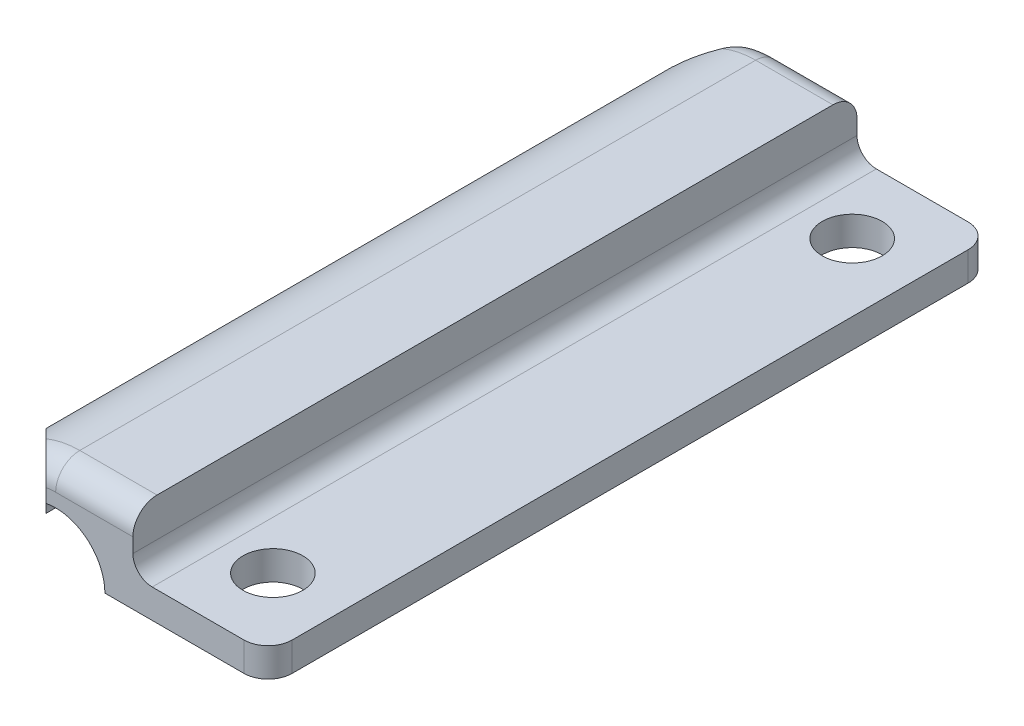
ISO-10303-21;
HEADER;
FILE_DESCRIPTION(('STEP AP214'),'2;1');
FILE_NAME('part.step','',(''),(''),'','','');
FILE_SCHEMA(('AUTOMOTIVE_DESIGN { 1 0 10303 214 1 1 1 1 }'));
ENDSEC;
DATA;
#1=APPLICATION_CONTEXT('core data for automotive mechanical design processes');
#2=APPLICATION_PROTOCOL_DEFINITION('international standard','automotive_design',2000,#1);
#3=PRODUCT_CONTEXT('',#1,'mechanical');
#4=PRODUCT('Part','Part','',(#3));
#5=PRODUCT_RELATED_PRODUCT_CATEGORY('part','',(#4));
#6=PRODUCT_DEFINITION_FORMATION('','',#4);
#7=PRODUCT_DEFINITION_CONTEXT('part definition',#1,'design');
#8=PRODUCT_DEFINITION('design','',#6,#7);
#9=PRODUCT_DEFINITION_SHAPE('','',#8);
#10=(LENGTH_UNIT() NAMED_UNIT(*) SI_UNIT(.MILLI.,.METRE.));
#11=(NAMED_UNIT(*) PLANE_ANGLE_UNIT() SI_UNIT($,.RADIAN.));
#12=(NAMED_UNIT(*) SI_UNIT($,.STERADIAN.) SOLID_ANGLE_UNIT());
#13=UNCERTAINTY_MEASURE_WITH_UNIT(LENGTH_MEASURE(1.E-05),#10,'distance_accuracy_value','');
#14=(GEOMETRIC_REPRESENTATION_CONTEXT(3) GLOBAL_UNCERTAINTY_ASSIGNED_CONTEXT((#13)) GLOBAL_UNIT_ASSIGNED_CONTEXT((#10,
#11,#12)) REPRESENTATION_CONTEXT('',''));
#15=CARTESIAN_POINT('',(0.,0.,0.));
#16=DIRECTION('',(0.,0.,1.));
#17=DIRECTION('',(1.,0.,0.));
#18=AXIS2_PLACEMENT_3D('',#15,#16,#17);
#19=CARTESIAN_POINT('',(24.,-3.4,15.));
#20=DIRECTION('',(0.,-1.,0.));
#21=DIRECTION('',(0.,0.,-1.));
#22=AXIS2_PLACEMENT_3D('',#19,#20,#21);
#23=PLANE('',#22);
#24=CARTESIAN_POINT('',(24.,-3.4,15.));
#25=DIRECTION('',(0.,1.,0.));
#26=DIRECTION('',(0.,0.,1.));
#27=AXIS2_PLACEMENT_3D('',#24,#25,#26);
#28=CIRCLE('',#27,3.);
#29=CARTESIAN_POINT('',(24.,-3.4,18.));
#30=VERTEX_POINT('',#29);
#31=EDGE_CURVE('E20',#30,#30,#28,.T.);
#32=ORIENTED_EDGE('',*,*,#31,.F.);
#33=EDGE_LOOP('',(#32));
#34=FACE_BOUND('',#33,.T.);
#35=ADVANCED_FACE('F17',(#34),#23,.T.);
#36=CARTESIAN_POINT('',(24.,-3.4,-15.));
#37=DIRECTION('',(0.,-1.,0.));
#38=DIRECTION('',(0.,0.,-1.));
#39=AXIS2_PLACEMENT_3D('',#36,#37,#38);
#40=PLANE('',#39);
#41=CARTESIAN_POINT('',(24.,-3.4,-15.));
#42=DIRECTION('',(0.,1.,0.));
#43=DIRECTION('',(0.,0.,1.));
#44=AXIS2_PLACEMENT_3D('',#41,#42,#43);
#45=CIRCLE('',#44,3.);
#46=CARTESIAN_POINT('',(24.,-3.4,-12.));
#47=VERTEX_POINT('',#46);
#48=EDGE_CURVE('E377',#47,#47,#45,.T.);
#49=ORIENTED_EDGE('',*,*,#48,.F.);
#50=EDGE_LOOP('',(#49));
#51=FACE_BOUND('',#50,.T.);
#52=ADVANCED_FACE('F387',(#51),#40,.T.);
#53=CARTESIAN_POINT('',(0.,9.,37.5));
#54=DIRECTION('',(0.,-1.,0.));
#55=DIRECTION('',(0.,0.,-1.));
#56=AXIS2_PLACEMENT_3D('',#53,#54,#55);
#57=PLANE('',#56);
#58=DIRECTION('',(0.,0.,-1.));
#59=VECTOR('',#58,1.);
#60=CARTESIAN_POINT('',(9.,9.,37.5));
#61=LINE('',#60,#59);
#62=CARTESIAN_POINT('',(9.,9.00000000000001,35.));
#63=VERTEX_POINT('',#62);
#64=CARTESIAN_POINT('',(9.,9.,-35.));
#65=VERTEX_POINT('',#64);
#66=EDGE_CURVE('E138',#63,#65,#61,.T.);
#67=ORIENTED_EDGE('',*,*,#66,.F.);
#68=DIRECTION('',(-1.,0.,0.));
#69=VECTOR('',#68,1.);
#70=CARTESIAN_POINT('',(0.,9.00000000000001,35.));
#71=LINE('',#70,#69);
#72=CARTESIAN_POINT('',(17.,9.00000000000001,35.));
#73=VERTEX_POINT('',#72);
#74=EDGE_CURVE('E141',#73,#63,#71,.T.);
#75=ORIENTED_EDGE('',*,*,#74,.F.);
#76=DIRECTION('',(0.,0.,1.));
#77=VECTOR('',#76,1.);
#78=CARTESIAN_POINT('',(17.,9.,37.5));
#79=LINE('',#78,#77);
#80=CARTESIAN_POINT('',(17.,9.00000000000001,-35.));
#81=VERTEX_POINT('',#80);
#82=EDGE_CURVE('E277',#73,#81,#79,.F.);
#83=ORIENTED_EDGE('',*,*,#82,.T.);
#84=DIRECTION('',(1.,0.,0.));
#85=VECTOR('',#84,1.);
#86=CARTESIAN_POINT('',(0.,9.00000000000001,-35.));
#87=LINE('',#86,#85);
#88=EDGE_CURVE('E115',#65,#81,#87,.T.);
#89=ORIENTED_EDGE('',*,*,#88,.F.);
#90=EDGE_LOOP('',(#67,#75,#83,#89));
#91=FACE_BOUND('',#90,.T.);
#92=ADVANCED_FACE('F140',(#91),#57,.F.);
#93=CARTESIAN_POINT('',(17.,3.,37.5));
#94=DIRECTION('',(-1.,0.,0.));
#95=DIRECTION('',(0.,0.,1.));
#96=AXIS2_PLACEMENT_3D('',#93,#94,#95);
#97=PLANE('',#96);
#98=CARTESIAN_POINT('',(17.,6.5,-35.));
#99=DIRECTION('',(1.,0.,0.));
#100=DIRECTION('',(0.,0.,-1.));
#101=AXIS2_PLACEMENT_3D('',#98,#99,#100);
#102=CIRCLE('',#101,2.5);
#103=CARTESIAN_POINT('',(17.,6.5,-37.5));
#104=VERTEX_POINT('',#103);
#105=EDGE_CURVE('E270',#81,#104,#102,.F.);
#106=ORIENTED_EDGE('',*,*,#105,.F.);
#107=ORIENTED_EDGE('',*,*,#82,.F.);
#108=CARTESIAN_POINT('',(17.,6.5,35.));
#109=DIRECTION('',(-1.,0.,0.));
#110=DIRECTION('',(0.,0.,1.));
#111=AXIS2_PLACEMENT_3D('',#108,#109,#110);
#112=CIRCLE('',#111,2.5);
#113=CARTESIAN_POINT('',(17.,6.5,37.5));
#114=VERTEX_POINT('',#113);
#115=EDGE_CURVE('E155',#114,#73,#112,.T.);
#116=ORIENTED_EDGE('',*,*,#115,.F.);
#117=DIRECTION('',(0.,1.,0.));
#118=VECTOR('',#117,1.);
#119=CARTESIAN_POINT('',(17.,3.,37.5));
#120=LINE('',#119,#118);
#121=CARTESIAN_POINT('',(17.,5.,37.5));
#122=VERTEX_POINT('',#121);
#123=EDGE_CURVE('E279',#122,#114,#120,.T.);
#124=ORIENTED_EDGE('',*,*,#123,.F.);
#125=DIRECTION('',(0.,0.,1.));
#126=VECTOR('',#125,1.);
#127=CARTESIAN_POINT('',(17.,5.,37.5));
#128=LINE('',#127,#126);
#129=CARTESIAN_POINT('',(17.,5.,-37.5));
#130=VERTEX_POINT('',#129);
#131=EDGE_CURVE('E168',#122,#130,#128,.F.);
#132=ORIENTED_EDGE('',*,*,#131,.T.);
#133=DIRECTION('',(0.,1.,0.));
#134=VECTOR('',#133,1.);
#135=CARTESIAN_POINT('',(17.,3.,-37.5));
#136=LINE('',#135,#134);
#137=EDGE_CURVE('E275',#104,#130,#136,.F.);
#138=ORIENTED_EDGE('',*,*,#137,.F.);
#139=EDGE_LOOP('',(#106,#107,#116,#124,#132,#138));
#140=FACE_BOUND('',#139,.T.);
#141=ADVANCED_FACE('F293',(#140),#97,.F.);
#142=CARTESIAN_POINT('',(24.,-3.4,15.));
#143=DIRECTION('',(0.,1.,0.));
#144=DIRECTION('',(0.,0.,1.));
#145=AXIS2_PLACEMENT_3D('',#142,#143,#144);
#146=CYLINDRICAL_SURFACE('',#145,3.);
#147=CARTESIAN_POINT('',(24.,0.,15.));
#148=DIRECTION('',(0.,1.,0.));
#149=DIRECTION('',(0.,0.,1.));
#150=AXIS2_PLACEMENT_3D('',#147,#148,#149);
#151=CIRCLE('',#150,3.);
#152=CARTESIAN_POINT('',(24.,0.,18.));
#153=VERTEX_POINT('',#152);
#154=EDGE_CURVE('E369',#153,#153,#151,.F.);
#155=ORIENTED_EDGE('',*,*,#154,.T.);
#156=EDGE_LOOP('',(#155));
#157=FACE_BOUND('',#156,.T.);
#158=ORIENTED_EDGE('',*,*,#31,.T.);
#159=EDGE_LOOP('',(#158));
#160=FACE_BOUND('',#159,.T.);
#161=ADVANCED_FACE('F384',(#157,#160),#146,.T.);
#162=CARTESIAN_POINT('',(24.,-3.4,-15.));
#163=DIRECTION('',(0.,1.,0.));
#164=DIRECTION('',(0.,0.,1.));
#165=AXIS2_PLACEMENT_3D('',#162,#163,#164);
#166=CYLINDRICAL_SURFACE('',#165,3.);
#167=ORIENTED_EDGE('',*,*,#48,.T.);
#168=EDGE_LOOP('',(#167));
#169=FACE_BOUND('',#168,.T.);
#170=CARTESIAN_POINT('',(24.,0.,-15.));
#171=DIRECTION('',(0.,1.,0.));
#172=DIRECTION('',(0.,0.,1.));
#173=AXIS2_PLACEMENT_3D('',#170,#171,#172);
#174=CIRCLE('',#173,3.);
#175=CARTESIAN_POINT('',(24.,0.,-12.));
#176=VERTEX_POINT('',#175);
#177=EDGE_CURVE('E366',#176,#176,#174,.F.);
#178=ORIENTED_EDGE('',*,*,#177,.T.);
#179=EDGE_LOOP('',(#178));
#180=FACE_BOUND('',#179,.T.);
#181=ADVANCED_FACE('F465',(#169,#180),#166,.T.);
#182=CARTESIAN_POINT('',(24.,0.,-30.));
#183=DIRECTION('',(0.,1.,0.));
#184=DIRECTION('',(0.,0.,1.));
#185=AXIS2_PLACEMENT_3D('',#182,#183,#184);
#186=CYLINDRICAL_SURFACE('',#185,3.1);
#187=CARTESIAN_POINT('',(24.,0.,-30.));
#188=DIRECTION('',(0.,1.,0.));
#189=DIRECTION('',(0.,0.,1.));
#190=AXIS2_PLACEMENT_3D('',#187,#188,#189);
#191=CIRCLE('',#190,3.1);
#192=CARTESIAN_POINT('',(24.,0.,-26.9));
#193=VERTEX_POINT('',#192);
#194=EDGE_CURVE('E363',#193,#193,#191,.F.);
#195=ORIENTED_EDGE('',*,*,#194,.T.);
#196=EDGE_LOOP('',(#195));
#197=FACE_BOUND('',#196,.T.);
#198=CARTESIAN_POINT('',(24.,3.,-30.));
#199=DIRECTION('',(0.,1.,0.));
#200=DIRECTION('',(0.,0.,1.));
#201=AXIS2_PLACEMENT_3D('',#198,#199,#200);
#202=CIRCLE('',#201,3.1);
#203=CARTESIAN_POINT('',(24.,3.,-26.9));
#204=VERTEX_POINT('',#203);
#205=EDGE_CURVE('E344',#204,#204,#202,.T.);
#206=ORIENTED_EDGE('',*,*,#205,.T.);
#207=EDGE_LOOP('',(#206));
#208=FACE_BOUND('',#207,.T.);
#209=ADVANCED_FACE('F461',(#197,#208),#186,.F.);
#210=CARTESIAN_POINT('',(31.,0.,37.5));
#211=DIRECTION('',(-1.,0.,0.));
#212=DIRECTION('',(0.,0.,1.));
#213=AXIS2_PLACEMENT_3D('',#210,#211,#212);
#214=PLANE('',#213);
#215=DIRECTION('',(0.,-1.,0.));
#216=VECTOR('',#215,1.);
#217=CARTESIAN_POINT('',(31.,0.,-35.));
#218=LINE('',#217,#216);
#219=CARTESIAN_POINT('',(31.,3.,-35.));
#220=VERTEX_POINT('',#219);
#221=CARTESIAN_POINT('',(31.,0.,-35.));
#222=VERTEX_POINT('',#221);
#223=EDGE_CURVE('E266',#220,#222,#218,.T.);
#224=ORIENTED_EDGE('',*,*,#223,.F.);
#225=DIRECTION('',(0.,0.,-1.));
#226=VECTOR('',#225,1.);
#227=CARTESIAN_POINT('',(31.,3.,37.5));
#228=LINE('',#227,#226);
#229=CARTESIAN_POINT('',(31.,3.,35.));
#230=VERTEX_POINT('',#229);
#231=EDGE_CURVE('E342',#220,#230,#228,.F.);
#232=ORIENTED_EDGE('',*,*,#231,.T.);
#233=DIRECTION('',(0.,1.,0.));
#234=VECTOR('',#233,1.);
#235=CARTESIAN_POINT('',(31.,9.,35.));
#236=LINE('',#235,#234);
#237=CARTESIAN_POINT('',(31.,0.,35.));
#238=VERTEX_POINT('',#237);
#239=EDGE_CURVE('E271',#238,#230,#236,.T.);
#240=ORIENTED_EDGE('',*,*,#239,.F.);
#241=DIRECTION('',(0.,0.,1.));
#242=VECTOR('',#241,1.);
#243=CARTESIAN_POINT('',(31.,0.,37.5));
#244=LINE('',#243,#242);
#245=EDGE_CURVE('E333',#238,#222,#244,.F.);
#246=ORIENTED_EDGE('',*,*,#245,.T.);
#247=EDGE_LOOP('',(#224,#232,#240,#246));
#248=FACE_BOUND('',#247,.T.);
#249=ADVANCED_FACE('F455',(#248),#214,.F.);
#250=CARTESIAN_POINT('',(24.,-3.4,30.));
#251=DIRECTION('',(0.,1.,0.));
#252=DIRECTION('',(0.,0.,1.));
#253=AXIS2_PLACEMENT_3D('',#250,#251,#252);
#254=CYLINDRICAL_SURFACE('',#253,3.1);
#255=CARTESIAN_POINT('',(24.,3.,30.));
#256=DIRECTION('',(0.,1.,0.));
#257=DIRECTION('',(0.,0.,1.));
#258=AXIS2_PLACEMENT_3D('',#255,#256,#257);
#259=CIRCLE('',#258,3.1);
#260=CARTESIAN_POINT('',(24.,3.,33.1));
#261=VERTEX_POINT('',#260);
#262=EDGE_CURVE('E274',#261,#261,#259,.T.);
#263=ORIENTED_EDGE('',*,*,#262,.T.);
#264=EDGE_LOOP('',(#263));
#265=FACE_BOUND('',#264,.T.);
#266=CARTESIAN_POINT('',(24.,0.,30.));
#267=DIRECTION('',(0.,1.,0.));
#268=DIRECTION('',(0.,0.,1.));
#269=AXIS2_PLACEMENT_3D('',#266,#267,#268);
#270=CIRCLE('',#269,3.1);
#271=CARTESIAN_POINT('',(24.,0.,33.1));
#272=VERTEX_POINT('',#271);
#273=EDGE_CURVE('E356',#272,#272,#270,.F.);
#274=ORIENTED_EDGE('',*,*,#273,.T.);
#275=EDGE_LOOP('',(#274));
#276=FACE_BOUND('',#275,.T.);
#277=ADVANCED_FACE('F450',(#265,#276),#254,.F.);
#278=CARTESIAN_POINT('',(0.,6.5,-35.));
#279=DIRECTION('',(1.,0.,0.));
#280=DIRECTION('',(0.,0.,-1.));
#281=AXIS2_PLACEMENT_3D('',#278,#279,#280);
#282=CYLINDRICAL_SURFACE('',#281,2.5);
#283=ORIENTED_EDGE('',*,*,#88,.T.);
#284=ORIENTED_EDGE('',*,*,#105,.T.);
#285=DIRECTION('',(-1.,0.,0.));
#286=VECTOR('',#285,1.);
#287=CARTESIAN_POINT('',(0.,6.5,-37.5));
#288=LINE('',#287,#286);
#289=CARTESIAN_POINT('',(9.,6.5,-37.5));
#290=VERTEX_POINT('',#289);
#291=EDGE_CURVE('E329',#290,#104,#288,.F.);
#292=ORIENTED_EDGE('',*,*,#291,.F.);
#293=CARTESIAN_POINT('',(9.,6.5,-35.));
#294=DIRECTION('',(1.,0.,0.));
#295=DIRECTION('',(0.,1.,0.));
#296=AXIS2_PLACEMENT_3D('',#293,#294,#295);
#297=CIRCLE('',#296,2.5);
#298=EDGE_CURVE('E145',#65,#290,#297,.F.);
#299=ORIENTED_EDGE('',*,*,#298,.F.);
#300=EDGE_LOOP('',(#283,#284,#292,#299));
#301=FACE_BOUND('',#300,.T.);
#302=ADVANCED_FACE('F448',(#301),#282,.T.);
#303=CARTESIAN_POINT('',(28.5,0.,-35.));
#304=DIRECTION('',(0.,-1.,0.));
#305=DIRECTION('',(0.,0.,-1.));
#306=AXIS2_PLACEMENT_3D('',#303,#304,#305);
#307=CYLINDRICAL_SURFACE('',#306,2.5);
#308=CARTESIAN_POINT('',(28.5,3.,-35.));
#309=DIRECTION('',(0.,-1.,0.));
#310=DIRECTION('',(0.,0.,-1.));
#311=AXIS2_PLACEMENT_3D('',#308,#309,#310);
#312=CIRCLE('',#311,2.5);
#313=CARTESIAN_POINT('',(28.5,3.,-37.5));
#314=VERTEX_POINT('',#313);
#315=EDGE_CURVE('E345',#314,#220,#312,.T.);
#316=ORIENTED_EDGE('',*,*,#315,.T.);
#317=ORIENTED_EDGE('',*,*,#223,.T.);
#318=CARTESIAN_POINT('',(28.5,0.,-35.));
#319=DIRECTION('',(0.,-1.,0.));
#320=DIRECTION('',(0.,0.,-1.));
#321=AXIS2_PLACEMENT_3D('',#318,#319,#320);
#322=CIRCLE('',#321,2.5);
#323=CARTESIAN_POINT('',(28.5,0.,-37.5));
#324=VERTEX_POINT('',#323);
#325=EDGE_CURVE('E336',#222,#324,#322,.F.);
#326=ORIENTED_EDGE('',*,*,#325,.T.);
#327=DIRECTION('',(0.,1.,0.));
#328=VECTOR('',#327,1.);
#329=CARTESIAN_POINT('',(28.5,9.,-37.5));
#330=LINE('',#329,#328);
#331=EDGE_CURVE('E247',#314,#324,#330,.F.);
#332=ORIENTED_EDGE('',*,*,#331,.F.);
#333=EDGE_LOOP('',(#316,#317,#326,#332));
#334=FACE_BOUND('',#333,.T.);
#335=ADVANCED_FACE('F237',(#334),#307,.T.);
#336=CARTESIAN_POINT('',(9.,0.,-35.));
#337=DIRECTION('',(0.,0.,-1.));
#338=DIRECTION('',(-1.,0.,0.));
#339=AXIS2_PLACEMENT_3D('',#336,#337,#338);
#340=TOROIDAL_SURFACE('',#339,6.5,2.5);
#341=CARTESIAN_POINT('',(9.,0.,-35.));
#342=DIRECTION('',(0.,0.,-1.));
#343=DIRECTION('',(-1.,0.,0.));
#344=AXIS2_PLACEMENT_3D('',#341,#342,#343);
#345=CIRCLE('',#344,9.);
#346=CARTESIAN_POINT('',(5.50000000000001,8.2915619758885,-35.));
#347=VERTEX_POINT('',#346);
#348=EDGE_CURVE('E144',#65,#347,#345,.F.);
#349=ORIENTED_EDGE('',*,*,#348,.F.);
#350=ORIENTED_EDGE('',*,*,#298,.T.);
#351=CARTESIAN_POINT('',(9.,0.,-37.5));
#352=DIRECTION('',(0.,0.,1.));
#353=DIRECTION('',(0.,1.,0.));
#354=AXIS2_PLACEMENT_3D('',#351,#352,#353);
#355=CIRCLE('',#354,6.5);
#356=CARTESIAN_POINT('',(8.,6.42261628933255,-37.5));
#357=VERTEX_POINT('',#356);
#358=EDGE_CURVE('E255',#357,#290,#355,.F.);
#359=ORIENTED_EDGE('',*,*,#358,.F.);
#360=CARTESIAN_POINT('',(5.5,8.2915619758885,-35.));
#361=CARTESIAN_POINT('',(5.57173141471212,8.32182772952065,-35.0717314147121));
#362=CARTESIAN_POINT('',(5.64428836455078,8.34801576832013,-35.1442883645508));
#363=CARTESIAN_POINT('',(5.79079152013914,8.39174016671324,-35.2907915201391));
#364=CARTESIAN_POINT('',(5.86473945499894,8.40926490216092,-35.3647394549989));
#365=CARTESIAN_POINT('',(6.08874277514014,8.44812316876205,-35.5887427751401));
#366=CARTESIAN_POINT('',(6.2402175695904,8.45542020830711,-35.7402175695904));
#367=CARTESIAN_POINT('',(6.50523072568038,8.4315949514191,-36.0052307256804));
#368=CARTESIAN_POINT('',(6.61919142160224,8.40923002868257,-36.1191914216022));
#369=CARTESIAN_POINT('',(6.84287099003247,8.33867814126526,-36.3428709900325));
#370=CARTESIAN_POINT('',(6.95260134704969,8.29056727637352,-36.4526013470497));
#371=CARTESIAN_POINT('',(7.14509503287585,8.17833129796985,-36.6450950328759));
#372=CARTESIAN_POINT('',(7.22915462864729,8.11865427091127,-36.7291546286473));
#373=CARTESIAN_POINT('',(7.38932492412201,7.98064369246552,-36.889324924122));
#374=CARTESIAN_POINT('',(7.46544010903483,7.90232075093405,-36.9654401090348));
#375=CARTESIAN_POINT('',(7.59488801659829,7.74177865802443,-37.0948880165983));
#376=CARTESIAN_POINT('',(7.64991124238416,7.66228605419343,-37.1499112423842));
#377=CARTESIAN_POINT('',(7.74993312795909,7.4914143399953,-37.2499331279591));
#378=CARTESIAN_POINT('',(7.79493693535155,7.40004137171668,-37.2949369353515));
#379=CARTESIAN_POINT('',(7.85336816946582,7.25533413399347,-37.3533681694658));
#380=CARTESIAN_POINT('',(7.87138375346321,7.20562021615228,-37.3713837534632));
#381=CARTESIAN_POINT('',(7.90407528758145,7.10405180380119,-37.4040752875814));
#382=CARTESIAN_POINT('',(7.91875286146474,7.05219836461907,-37.4187528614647));
#383=CARTESIAN_POINT('',(7.94455694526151,6.94680499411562,-37.4445569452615));
#384=CARTESIAN_POINT('',(7.95568644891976,6.89326652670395,-37.4556864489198));
#385=CARTESIAN_POINT('',(7.97427206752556,6.7849535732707,-37.4742720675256));
#386=CARTESIAN_POINT('',(7.98173015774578,6.73017976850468,-37.4817301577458));
#387=CARTESIAN_POINT('',(7.99157013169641,6.63321080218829,-37.4915701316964));
#388=CARTESIAN_POINT('',(7.99474291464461,6.59117212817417,-37.4947429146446));
#389=CARTESIAN_POINT('',(7.99895806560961,6.50696128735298,-37.4989580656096));
#390=CARTESIAN_POINT('',(8.00000445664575,6.46478952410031,-37.5000044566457));
#391=CARTESIAN_POINT('',(8.,6.42261628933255,-37.5));
#392=B_SPLINE_CURVE_WITH_KNOTS('',3,(#360,#361,#362,#363,#364,#365,#366,#367,#368,#369,#370,
#371,#372,#373,#374,#375,#376,#377,#378,#379,#380,#381,#382,#383,#384,#385,#386,#387,#388,#389,
#390,#391),.UNSPECIFIED.,.F.,.F.,(4,2,2,2,2,2,2,2,2,2,2,2,2,2,2,4),(0.,0.317388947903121,
0.635202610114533,1.27407237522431,1.76039918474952,2.24529638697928,2.64281422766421,
3.04010641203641,3.37249831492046,3.70471905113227,3.87210568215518,4.03941071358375,
4.20657420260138,4.37364765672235,4.50037650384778,4.62686536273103),.UNSPECIFIED.);
#393=EDGE_CURVE('E229',#347,#357,#392,.T.);
#394=ORIENTED_EDGE('',*,*,#393,.F.);
#395=EDGE_LOOP('',(#349,#350,#359,#394));
#396=FACE_BOUND('',#395,.T.);
#397=ADVANCED_FACE('F232',(#396),#340,.T.);
#398=CARTESIAN_POINT('',(9.,0.,37.5));
#399=DIRECTION('',(0.,0.,-1.));
#400=DIRECTION('',(-1.,0.,0.));
#401=AXIS2_PLACEMENT_3D('',#398,#399,#400);
#402=CYLINDRICAL_SURFACE('',#401,9.);
#403=CARTESIAN_POINT('',(9.,0.,-38.5));
#404=DIRECTION('',(-0.707106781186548,0.,-0.707106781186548));
#405=DIRECTION('',(0.707106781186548,0.,-0.707106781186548));
#406=AXIS2_PLACEMENT_3D('',#403,#404,#405);
#407=ELLIPSE('',#406,12.7279220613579,9.);
#408=CARTESIAN_POINT('',(0.,0.,-29.5));
#409=VERTEX_POINT('',#408);
#410=EDGE_CURVE('E230',#409,#347,#407,.T.);
#411=ORIENTED_EDGE('',*,*,#410,.F.);
#412=DIRECTION('',(0.,0.,1.));
#413=VECTOR('',#412,1.);
#414=CARTESIAN_POINT('',(0.,0.,37.5));
#415=LINE('',#414,#413);
#416=CARTESIAN_POINT('',(0.,0.,29.5));
#417=VERTEX_POINT('',#416);
#418=EDGE_CURVE('E245',#409,#417,#415,.T.);
#419=ORIENTED_EDGE('',*,*,#418,.T.);
#420=CARTESIAN_POINT('',(9.,0.,38.5));
#421=DIRECTION('',(0.707106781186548,0.,-0.707106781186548));
#422=DIRECTION('',(-0.707106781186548,0.,-0.707106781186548));
#423=AXIS2_PLACEMENT_3D('',#420,#421,#422);
#424=ELLIPSE('',#423,12.7279220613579,9.);
#425=CARTESIAN_POINT('',(5.5,8.2915619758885,35.));
#426=VERTEX_POINT('',#425);
#427=EDGE_CURVE('E161',#417,#426,#424,.T.);
#428=ORIENTED_EDGE('',*,*,#427,.T.);
#429=CARTESIAN_POINT('',(9.,0.,35.));
#430=DIRECTION('',(0.,0.,-1.));
#431=DIRECTION('',(-1.,0.,0.));
#432=AXIS2_PLACEMENT_3D('',#429,#430,#431);
#433=CIRCLE('',#432,9.);
#434=EDGE_CURVE('E156',#63,#426,#433,.F.);
#435=ORIENTED_EDGE('',*,*,#434,.F.);
#436=ORIENTED_EDGE('',*,*,#66,.T.);
#437=ORIENTED_EDGE('',*,*,#348,.T.);
#438=EDGE_LOOP('',(#411,#419,#428,#435,#436,#437));
#439=FACE_BOUND('',#438,.T.);
#440=ADVANCED_FACE('F159',(#439),#402,.T.);
#441=CARTESIAN_POINT('',(9.,0.,35.));
#442=DIRECTION('',(0.,0.,-1.));
#443=DIRECTION('',(-1.,0.,0.));
#444=AXIS2_PLACEMENT_3D('',#441,#442,#443);
#445=TOROIDAL_SURFACE('',#444,6.5,2.5);
#446=CARTESIAN_POINT('',(9.,6.5,35.));
#447=DIRECTION('',(-1.,0.,0.));
#448=DIRECTION('',(0.,0.,1.));
#449=AXIS2_PLACEMENT_3D('',#446,#447,#448);
#450=CIRCLE('',#449,2.5);
#451=CARTESIAN_POINT('',(9.,6.5,37.5));
#452=VERTEX_POINT('',#451);
#453=EDGE_CURVE('E153',#63,#452,#450,.F.);
#454=ORIENTED_EDGE('',*,*,#453,.F.);
#455=ORIENTED_EDGE('',*,*,#434,.T.);
#456=CARTESIAN_POINT('',(5.5,8.2915619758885,35.));
#457=CARTESIAN_POINT('',(5.57173141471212,8.32182772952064,35.0717314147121));
#458=CARTESIAN_POINT('',(5.64428836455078,8.34801576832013,35.1442883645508));
#459=CARTESIAN_POINT('',(5.79079152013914,8.39174016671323,35.2907915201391));
#460=CARTESIAN_POINT('',(5.86473945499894,8.40926490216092,35.3647394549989));
#461=CARTESIAN_POINT('',(6.08874277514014,8.44812316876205,35.5887427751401));
#462=CARTESIAN_POINT('',(6.24021756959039,8.45542020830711,35.7402175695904));
#463=CARTESIAN_POINT('',(6.50523072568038,8.4315949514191,36.0052307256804));
#464=CARTESIAN_POINT('',(6.61919142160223,8.40923002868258,36.1191914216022));
#465=CARTESIAN_POINT('',(6.84287099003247,8.33867814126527,36.3428709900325));
#466=CARTESIAN_POINT('',(6.95260134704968,8.29056727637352,36.4526013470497));
#467=CARTESIAN_POINT('',(7.14509503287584,8.17833129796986,36.6450950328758));
#468=CARTESIAN_POINT('',(7.22915462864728,8.11865427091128,36.7291546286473));
#469=CARTESIAN_POINT('',(7.38932492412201,7.98064369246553,36.889324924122));
#470=CARTESIAN_POINT('',(7.46544010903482,7.90232075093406,36.9654401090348));
#471=CARTESIAN_POINT('',(7.59488801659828,7.74177865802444,37.0948880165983));
#472=CARTESIAN_POINT('',(7.64991124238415,7.66228605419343,37.1499112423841));
#473=CARTESIAN_POINT('',(7.74993312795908,7.49141433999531,37.2499331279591));
#474=CARTESIAN_POINT('',(7.79493693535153,7.40004137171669,37.2949369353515));
#475=CARTESIAN_POINT('',(7.85336816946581,7.25533413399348,37.3533681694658));
#476=CARTESIAN_POINT('',(7.87138375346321,7.2056202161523,37.3713837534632));
#477=CARTESIAN_POINT('',(7.90407528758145,7.10405180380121,37.4040752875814));
#478=CARTESIAN_POINT('',(7.91875286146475,7.05219836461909,37.4187528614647));
#479=CARTESIAN_POINT('',(7.94455694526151,6.94680499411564,37.4445569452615));
#480=CARTESIAN_POINT('',(7.95568644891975,6.89326652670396,37.4556864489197));
#481=CARTESIAN_POINT('',(7.97427206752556,6.78495357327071,37.4742720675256));
#482=CARTESIAN_POINT('',(7.98173015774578,6.7301797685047,37.4817301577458));
#483=CARTESIAN_POINT('',(7.99157013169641,6.6332108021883,37.4915701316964));
#484=CARTESIAN_POINT('',(7.99474291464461,6.59117212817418,37.4947429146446));
#485=CARTESIAN_POINT('',(7.99895806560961,6.506961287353,37.4989580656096));
#486=CARTESIAN_POINT('',(8.00000445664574,6.46478952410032,37.5000044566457));
#487=CARTESIAN_POINT('',(8.,6.42261628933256,37.5));
#488=B_SPLINE_CURVE_WITH_KNOTS('',3,(#456,#457,#458,#459,#460,#461,#462,#463,#464,#465,#466,
#467,#468,#469,#470,#471,#472,#473,#474,#475,#476,#477,#478,#479,#480,#481,#482,#483,#484,#485,
#486,#487),.UNSPECIFIED.,.F.,.F.,(4,2,2,2,2,2,2,2,2,2,2,2,2,2,2,4),(0.,0.317388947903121,
0.635202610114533,1.27407237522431,1.76039918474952,2.24529638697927,2.6428142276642,
3.04010641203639,3.37249831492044,3.70471905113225,3.87210568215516,4.03941071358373,
4.20657420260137,4.37364765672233,4.50037650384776,4.62686536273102),.UNSPECIFIED.);
#489=CARTESIAN_POINT('',(8.,6.42261628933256,37.5));
#490=VERTEX_POINT('',#489);
#491=EDGE_CURVE('E198',#426,#490,#488,.T.);
#492=ORIENTED_EDGE('',*,*,#491,.T.);
#493=CARTESIAN_POINT('',(9.,0.,37.5));
#494=DIRECTION('',(0.,0.,-1.));
#495=DIRECTION('',(-0.153846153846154,0.988094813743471,0.));
#496=AXIS2_PLACEMENT_3D('',#493,#494,#495);
#497=CIRCLE('',#496,6.5);
#498=EDGE_CURVE('E132',#490,#452,#497,.T.);
#499=ORIENTED_EDGE('',*,*,#498,.T.);
#500=EDGE_LOOP('',(#454,#455,#492,#499));
#501=FACE_BOUND('',#500,.T.);
#502=ADVANCED_FACE('F165',(#501),#445,.T.);
#503=CARTESIAN_POINT('',(0.,6.5,35.));
#504=DIRECTION('',(-1.,0.,0.));
#505=DIRECTION('',(0.,0.,1.));
#506=AXIS2_PLACEMENT_3D('',#503,#504,#505);
#507=CYLINDRICAL_SURFACE('',#506,2.5);
#508=DIRECTION('',(-1.,0.,0.));
#509=VECTOR('',#508,1.);
#510=CARTESIAN_POINT('',(0.,6.5,37.5));
#511=LINE('',#510,#509);
#512=EDGE_CURVE('E285',#452,#114,#511,.F.);
#513=ORIENTED_EDGE('',*,*,#512,.T.);
#514=ORIENTED_EDGE('',*,*,#115,.T.);
#515=ORIENTED_EDGE('',*,*,#74,.T.);
#516=ORIENTED_EDGE('',*,*,#453,.T.);
#517=EDGE_LOOP('',(#513,#514,#515,#516));
#518=FACE_BOUND('',#517,.T.);
#519=ADVANCED_FACE('F151',(#518),#507,.T.);
#520=CARTESIAN_POINT('',(19.,5.,37.5));
#521=DIRECTION('',(0.,0.,1.));
#522=DIRECTION('',(1.,0.,0.));
#523=AXIS2_PLACEMENT_3D('',#520,#521,#522);
#524=CYLINDRICAL_SURFACE('',#523,2.);
#525=DIRECTION('',(0.,0.,-1.));
#526=VECTOR('',#525,1.);
#527=CARTESIAN_POINT('',(19.,3.,37.5));
#528=LINE('',#527,#526);
#529=CARTESIAN_POINT('',(19.,3.,37.5));
#530=VERTEX_POINT('',#529);
#531=CARTESIAN_POINT('',(19.,3.,-37.5));
#532=VERTEX_POINT('',#531);
#533=EDGE_CURVE('E346',#530,#532,#528,.T.);
#534=ORIENTED_EDGE('',*,*,#533,.T.);
#535=CARTESIAN_POINT('',(19.,5.,-37.5));
#536=DIRECTION('',(0.,0.,1.));
#537=DIRECTION('',(1.,0.,0.));
#538=AXIS2_PLACEMENT_3D('',#535,#536,#537);
#539=CIRCLE('',#538,2.);
#540=EDGE_CURVE('E328',#130,#532,#539,.T.);
#541=ORIENTED_EDGE('',*,*,#540,.F.);
#542=ORIENTED_EDGE('',*,*,#131,.F.);
#543=CARTESIAN_POINT('',(19.,5.,37.5));
#544=DIRECTION('',(0.,0.,1.));
#545=DIRECTION('',(1.,0.,0.));
#546=AXIS2_PLACEMENT_3D('',#543,#544,#545);
#547=CIRCLE('',#546,2.);
#548=EDGE_CURVE('E288',#122,#530,#547,.T.);
#549=ORIENTED_EDGE('',*,*,#548,.T.);
#550=EDGE_LOOP('',(#534,#541,#542,#549));
#551=FACE_BOUND('',#550,.T.);
#552=ADVANCED_FACE('F354',(#551),#524,.F.);
#553=CARTESIAN_POINT('',(17.,3.,37.5));
#554=DIRECTION('',(0.,-1.,0.));
#555=DIRECTION('',(0.,0.,-1.));
#556=AXIS2_PLACEMENT_3D('',#553,#554,#555);
#557=PLANE('',#556);
#558=ORIENTED_EDGE('',*,*,#262,.F.);
#559=EDGE_LOOP('',(#558));
#560=FACE_BOUND('',#559,.T.);
#561=ORIENTED_EDGE('',*,*,#205,.F.);
#562=EDGE_LOOP('',(#561));
#563=FACE_BOUND('',#562,.T.);
#564=ORIENTED_EDGE('',*,*,#315,.F.);
#565=DIRECTION('',(-1.,0.,0.));
#566=VECTOR('',#565,1.);
#567=CARTESIAN_POINT('',(0.,3.,-37.5));
#568=LINE('',#567,#566);
#569=EDGE_CURVE('E250',#532,#314,#568,.F.);
#570=ORIENTED_EDGE('',*,*,#569,.F.);
#571=ORIENTED_EDGE('',*,*,#533,.F.);
#572=DIRECTION('',(-1.,0.,0.));
#573=VECTOR('',#572,1.);
#574=CARTESIAN_POINT('',(0.,3.,37.5));
#575=LINE('',#574,#573);
#576=CARTESIAN_POINT('',(28.5,3.,37.5));
#577=VERTEX_POINT('',#576);
#578=EDGE_CURVE('E295',#530,#577,#575,.F.);
#579=ORIENTED_EDGE('',*,*,#578,.T.);
#580=CARTESIAN_POINT('',(28.5,3.,35.));
#581=DIRECTION('',(0.,1.,0.));
#582=DIRECTION('',(0.,0.,1.));
#583=AXIS2_PLACEMENT_3D('',#580,#581,#582);
#584=CIRCLE('',#583,2.5);
#585=EDGE_CURVE('E273',#230,#577,#584,.F.);
#586=ORIENTED_EDGE('',*,*,#585,.F.);
#587=ORIENTED_EDGE('',*,*,#231,.F.);
#588=EDGE_LOOP('',(#564,#570,#571,#579,#586,#587));
#589=FACE_BOUND('',#588,.T.);
#590=ADVANCED_FACE('F435',(#560,#563,#589),#557,.F.);
#591=CARTESIAN_POINT('',(28.5,9.,35.));
#592=DIRECTION('',(0.,1.,0.));
#593=DIRECTION('',(0.,0.,1.));
#594=AXIS2_PLACEMENT_3D('',#591,#592,#593);
#595=CYLINDRICAL_SURFACE('',#594,2.5);
#596=ORIENTED_EDGE('',*,*,#585,.T.);
#597=DIRECTION('',(0.,1.,0.));
#598=VECTOR('',#597,1.);
#599=CARTESIAN_POINT('',(28.5,9.,37.5));
#600=LINE('',#599,#598);
#601=CARTESIAN_POINT('',(28.5,0.,37.5));
#602=VERTEX_POINT('',#601);
#603=EDGE_CURVE('E338',#577,#602,#600,.F.);
#604=ORIENTED_EDGE('',*,*,#603,.T.);
#605=CARTESIAN_POINT('',(28.5,0.,35.));
#606=DIRECTION('',(0.,1.,0.));
#607=DIRECTION('',(0.,0.,1.));
#608=AXIS2_PLACEMENT_3D('',#605,#606,#607);
#609=CIRCLE('',#608,2.5);
#610=EDGE_CURVE('E337',#602,#238,#609,.T.);
#611=ORIENTED_EDGE('',*,*,#610,.T.);
#612=ORIENTED_EDGE('',*,*,#239,.T.);
#613=EDGE_LOOP('',(#596,#604,#611,#612));
#614=FACE_BOUND('',#613,.T.);
#615=ADVANCED_FACE('F431',(#614),#595,.T.);
#616=CARTESIAN_POINT('',(0.,0.,37.5));
#617=DIRECTION('',(0.,1.,0.));
#618=DIRECTION('',(0.,0.,1.));
#619=AXIS2_PLACEMENT_3D('',#616,#617,#618);
#620=PLANE('',#619);
#621=ORIENTED_EDGE('',*,*,#273,.F.);
#622=EDGE_LOOP('',(#621));
#623=FACE_BOUND('',#622,.T.);
#624=ORIENTED_EDGE('',*,*,#325,.F.);
#625=ORIENTED_EDGE('',*,*,#245,.F.);
#626=ORIENTED_EDGE('',*,*,#610,.F.);
#627=DIRECTION('',(-1.,0.,0.));
#628=VECTOR('',#627,1.);
#629=CARTESIAN_POINT('',(0.,0.,37.5));
#630=LINE('',#629,#628);
#631=CARTESIAN_POINT('',(14.1,0.,37.5));
#632=VERTEX_POINT('',#631);
#633=EDGE_CURVE('E341',#602,#632,#630,.T.);
#634=ORIENTED_EDGE('',*,*,#633,.T.);
#635=DIRECTION('',(0.,0.,1.));
#636=VECTOR('',#635,1.);
#637=CARTESIAN_POINT('',(14.1,0.,-50.));
#638=LINE('',#637,#636);
#639=CARTESIAN_POINT('',(14.1,0.,-37.5));
#640=VERTEX_POINT('',#639);
#641=EDGE_CURVE('E127',#632,#640,#638,.F.);
#642=ORIENTED_EDGE('',*,*,#641,.T.);
#643=DIRECTION('',(-1.,0.,0.));
#644=VECTOR('',#643,1.);
#645=CARTESIAN_POINT('',(0.,0.,-37.5));
#646=LINE('',#645,#644);
#647=EDGE_CURVE('E249',#324,#640,#646,.T.);
#648=ORIENTED_EDGE('',*,*,#647,.F.);
#649=EDGE_LOOP('',(#624,#625,#626,#634,#642,#648));
#650=FACE_BOUND('',#649,.T.);
#651=ORIENTED_EDGE('',*,*,#194,.F.);
#652=EDGE_LOOP('',(#651));
#653=FACE_BOUND('',#652,.T.);
#654=ORIENTED_EDGE('',*,*,#177,.F.);
#655=EDGE_LOOP('',(#654));
#656=FACE_BOUND('',#655,.T.);
#657=ORIENTED_EDGE('',*,*,#154,.F.);
#658=EDGE_LOOP('',(#657));
#659=FACE_BOUND('',#658,.T.);
#660=ADVANCED_FACE('F424',(#623,#650,#653,#656,#659),#620,.F.);
#661=CARTESIAN_POINT('',(0.,9.,-37.5));
#662=DIRECTION('',(0.,0.,-1.));
#663=DIRECTION('',(-1.,0.,0.));
#664=AXIS2_PLACEMENT_3D('',#661,#662,#663);
#665=PLANE('',#664);
#666=ORIENTED_EDGE('',*,*,#331,.T.);
#667=ORIENTED_EDGE('',*,*,#647,.T.);
#668=CARTESIAN_POINT('',(9.,0.,-37.5));
#669=DIRECTION('',(0.,0.,1.));
#670=DIRECTION('',(1.,0.,0.));
#671=AXIS2_PLACEMENT_3D('',#668,#669,#670);
#672=CIRCLE('',#671,5.1);
#673=CARTESIAN_POINT('',(8.,5.00099990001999,-37.5));
#674=VERTEX_POINT('',#673);
#675=EDGE_CURVE('E302',#640,#674,#672,.T.);
#676=ORIENTED_EDGE('',*,*,#675,.T.);
#677=DIRECTION('',(0.,1.,0.));
#678=VECTOR('',#677,1.);
#679=CARTESIAN_POINT('',(8.,20.3137084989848,-37.5));
#680=LINE('',#679,#678);
#681=EDGE_CURVE('E309',#357,#674,#680,.F.);
#682=ORIENTED_EDGE('',*,*,#681,.F.);
#683=ORIENTED_EDGE('',*,*,#358,.T.);
#684=ORIENTED_EDGE('',*,*,#291,.T.);
#685=ORIENTED_EDGE('',*,*,#137,.T.);
#686=ORIENTED_EDGE('',*,*,#540,.T.);
#687=ORIENTED_EDGE('',*,*,#569,.T.);
#688=EDGE_LOOP('',(#666,#667,#676,#682,#683,#684,#685,#686,#687));
#689=FACE_BOUND('',#688,.T.);
#690=ADVANCED_FACE('F218',(#689),#665,.T.);
#691=CARTESIAN_POINT('',(8.,20.3137084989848,-37.5));
#692=DIRECTION('',(-0.707106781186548,0.,-0.707106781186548));
#693=DIRECTION('',(-0.707106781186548,0.,0.707106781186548));
#694=AXIS2_PLACEMENT_3D('',#691,#692,#693);
#695=PLANE('',#694);
#696=ORIENTED_EDGE('',*,*,#393,.T.);
#697=ORIENTED_EDGE('',*,*,#681,.T.);
#698=CARTESIAN_POINT('',(9.,0.,-38.5));
#699=DIRECTION('',(-0.707106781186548,0.,-0.707106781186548));
#700=DIRECTION('',(-0.707106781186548,0.,0.707106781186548));
#701=AXIS2_PLACEMENT_3D('',#698,#699,#700);
#702=ELLIPSE('',#701,7.21248916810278,5.1);
#703=CARTESIAN_POINT('',(3.9,0.,-33.4));
#704=VERTEX_POINT('',#703);
#705=EDGE_CURVE('E407',#674,#704,#702,.F.);
#706=ORIENTED_EDGE('',*,*,#705,.T.);
#707=DIRECTION('',(-0.707106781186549,0.,0.707106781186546));
#708=VECTOR('',#707,1.);
#709=CARTESIAN_POINT('',(3.9,0.,-33.4));
#710=LINE('',#709,#708);
#711=EDGE_CURVE('E306',#704,#409,#710,.T.);
#712=ORIENTED_EDGE('',*,*,#711,.T.);
#713=ORIENTED_EDGE('',*,*,#410,.T.);
#714=EDGE_LOOP('',(#696,#697,#706,#712,#713));
#715=FACE_BOUND('',#714,.T.);
#716=ADVANCED_FACE('F213',(#715),#695,.T.);
#717=CARTESIAN_POINT('',(0.,0.,37.5));
#718=DIRECTION('',(0.,1.,0.));
#719=DIRECTION('',(0.,0.,1.));
#720=AXIS2_PLACEMENT_3D('',#717,#718,#719);
#721=PLANE('',#720);
#722=DIRECTION('',(-0.707106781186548,0.,-0.707106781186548));
#723=VECTOR('',#722,1.);
#724=CARTESIAN_POINT('',(8.,0.,37.5));
#725=LINE('',#724,#723);
#726=CARTESIAN_POINT('',(3.9,0.,33.4));
#727=VERTEX_POINT('',#726);
#728=EDGE_CURVE('E303',#727,#417,#725,.T.);
#729=ORIENTED_EDGE('',*,*,#728,.T.);
#730=ORIENTED_EDGE('',*,*,#418,.F.);
#731=ORIENTED_EDGE('',*,*,#711,.F.);
#732=DIRECTION('',(0.,0.,1.));
#733=VECTOR('',#732,1.);
#734=CARTESIAN_POINT('',(3.9,0.,-50.));
#735=LINE('',#734,#733);
#736=EDGE_CURVE('E403',#704,#727,#735,.T.);
#737=ORIENTED_EDGE('',*,*,#736,.T.);
#738=EDGE_LOOP('',(#729,#730,#731,#737));
#739=FACE_BOUND('',#738,.T.);
#740=ADVANCED_FACE('F207',(#739),#721,.F.);
#741=CARTESIAN_POINT('',(8.,20.3137084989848,37.5));
#742=DIRECTION('',(0.707106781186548,0.,-0.707106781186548));
#743=DIRECTION('',(-0.707106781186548,0.,-0.707106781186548));
#744=AXIS2_PLACEMENT_3D('',#741,#742,#743);
#745=PLANE('',#744);
#746=ORIENTED_EDGE('',*,*,#491,.F.);
#747=ORIENTED_EDGE('',*,*,#427,.F.);
#748=ORIENTED_EDGE('',*,*,#728,.F.);
#749=CARTESIAN_POINT('',(9.,0.,38.5));
#750=DIRECTION('',(0.707106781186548,0.,-0.707106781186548));
#751=DIRECTION('',(0.707106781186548,0.,0.707106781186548));
#752=AXIS2_PLACEMENT_3D('',#749,#750,#751);
#753=ELLIPSE('',#752,7.21248916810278,5.1);
#754=CARTESIAN_POINT('',(8.,5.00099990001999,37.5));
#755=VERTEX_POINT('',#754);
#756=EDGE_CURVE('E26',#727,#755,#753,.T.);
#757=ORIENTED_EDGE('',*,*,#756,.T.);
#758=DIRECTION('',(0.,1.,0.));
#759=VECTOR('',#758,1.);
#760=CARTESIAN_POINT('',(8.,9.,37.5));
#761=LINE('',#760,#759);
#762=EDGE_CURVE('E34',#755,#490,#761,.T.);
#763=ORIENTED_EDGE('',*,*,#762,.T.);
#764=EDGE_LOOP('',(#746,#747,#748,#757,#763));
#765=FACE_BOUND('',#764,.T.);
#766=ADVANCED_FACE('F201',(#765),#745,.F.);
#767=CARTESIAN_POINT('',(0.,9.,37.5));
#768=DIRECTION('',(0.,0.,-1.));
#769=DIRECTION('',(-1.,0.,0.));
#770=AXIS2_PLACEMENT_3D('',#767,#768,#769);
#771=PLANE('',#770);
#772=ORIENTED_EDGE('',*,*,#762,.F.);
#773=CARTESIAN_POINT('',(9.,0.,37.5));
#774=DIRECTION('',(0.,0.,1.));
#775=DIRECTION('',(1.,0.,0.));
#776=AXIS2_PLACEMENT_3D('',#773,#774,#775);
#777=CIRCLE('',#776,5.1);
#778=EDGE_CURVE('E11',#755,#632,#777,.F.);
#779=ORIENTED_EDGE('',*,*,#778,.T.);
#780=ORIENTED_EDGE('',*,*,#633,.F.);
#781=ORIENTED_EDGE('',*,*,#603,.F.);
#782=ORIENTED_EDGE('',*,*,#578,.F.);
#783=ORIENTED_EDGE('',*,*,#548,.F.);
#784=ORIENTED_EDGE('',*,*,#123,.T.);
#785=ORIENTED_EDGE('',*,*,#512,.F.);
#786=ORIENTED_EDGE('',*,*,#498,.F.);
#787=EDGE_LOOP('',(#772,#779,#780,#781,#782,#783,#784,#785,#786));
#788=FACE_BOUND('',#787,.T.);
#789=ADVANCED_FACE('F206',(#788),#771,.F.);
#790=CARTESIAN_POINT('',(9.,0.,-50.));
#791=DIRECTION('',(0.,0.,1.));
#792=DIRECTION('',(1.,0.,0.));
#793=AXIS2_PLACEMENT_3D('',#790,#791,#792);
#794=CYLINDRICAL_SURFACE('',#793,5.1);
#795=ORIENTED_EDGE('',*,*,#756,.F.);
#796=ORIENTED_EDGE('',*,*,#736,.F.);
#797=ORIENTED_EDGE('',*,*,#705,.F.);
#798=ORIENTED_EDGE('',*,*,#675,.F.);
#799=ORIENTED_EDGE('',*,*,#641,.F.);
#800=ORIENTED_EDGE('',*,*,#778,.F.);
#801=EDGE_LOOP('',(#795,#796,#797,#798,#799,#800));
#802=FACE_BOUND('',#801,.T.);
#803=ADVANCED_FACE('F393',(#802),#794,.F.);
#804=CLOSED_SHELL('',(#35,#52,#92,#141,#161,#181,#209,#249,#277,#302,#335,#397,#440,#502,#519,
#552,#590,#615,#660,#690,#716,#740,#766,#789,#803));
#805=MANIFOLD_SOLID_BREP('B1',#804);
#806=ADVANCED_BREP_SHAPE_REPRESENTATION('',(#18,#805),#14);
#807=SHAPE_DEFINITION_REPRESENTATION(#9,#806);
ENDSEC;
END-ISO-10303-21;
